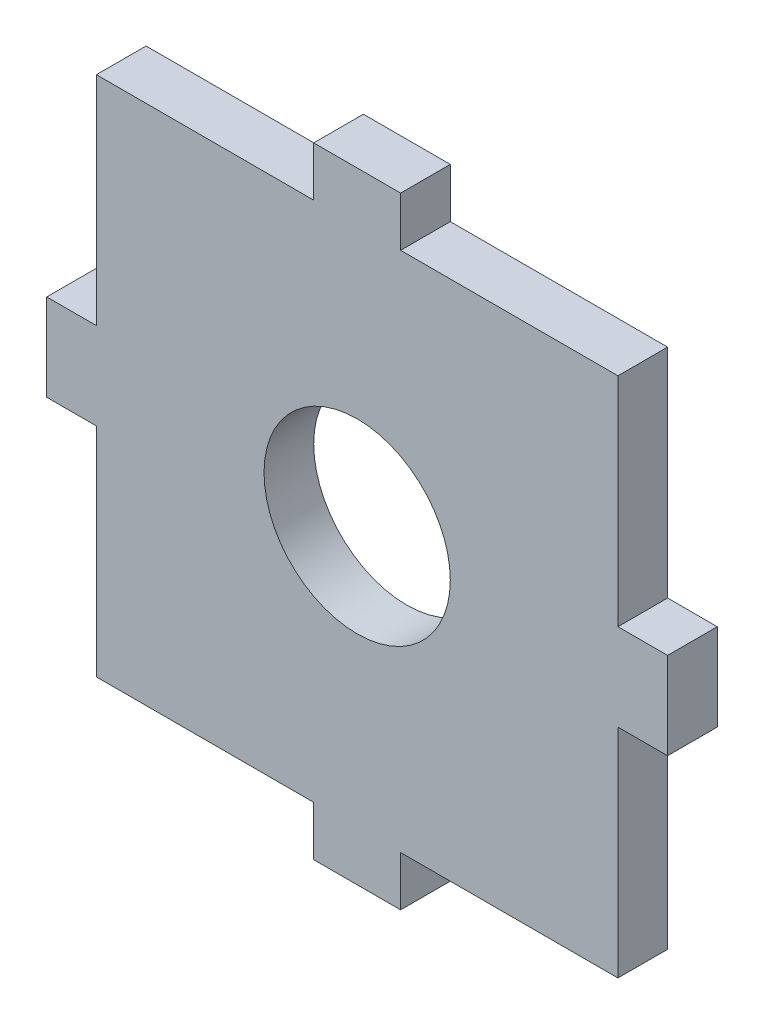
ISO-10303-21;
HEADER;
FILE_DESCRIPTION(('STEP AP214'),'2;1');
FILE_NAME('part.step','',(''),(''),'','','');
FILE_SCHEMA(('AUTOMOTIVE_DESIGN { 1 0 10303 214 1 1 1 1 }'));
ENDSEC;
DATA;
#1=APPLICATION_CONTEXT('core data for automotive mechanical design processes');
#2=APPLICATION_PROTOCOL_DEFINITION('international standard','automotive_design',2000,#1);
#3=PRODUCT_CONTEXT('',#1,'mechanical');
#4=PRODUCT('Part','Part','',(#3));
#5=PRODUCT_RELATED_PRODUCT_CATEGORY('part','',(#4));
#6=PRODUCT_DEFINITION_FORMATION('','',#4);
#7=PRODUCT_DEFINITION_CONTEXT('part definition',#1,'design');
#8=PRODUCT_DEFINITION('design','',#6,#7);
#9=PRODUCT_DEFINITION_SHAPE('','',#8);
#10=(LENGTH_UNIT() NAMED_UNIT(*) SI_UNIT(.MILLI.,.METRE.));
#11=(NAMED_UNIT(*) PLANE_ANGLE_UNIT() SI_UNIT($,.RADIAN.));
#12=(NAMED_UNIT(*) SI_UNIT($,.STERADIAN.) SOLID_ANGLE_UNIT());
#13=UNCERTAINTY_MEASURE_WITH_UNIT(LENGTH_MEASURE(1.E-05),#10,'distance_accuracy_value','');
#14=(GEOMETRIC_REPRESENTATION_CONTEXT(3) GLOBAL_UNCERTAINTY_ASSIGNED_CONTEXT((#13)) GLOBAL_UNIT_ASSIGNED_CONTEXT((#10,
#11,#12)) REPRESENTATION_CONTEXT('',''));
#15=CARTESIAN_POINT('',(0.,0.,0.));
#16=DIRECTION('',(0.,0.,1.));
#17=DIRECTION('',(1.,0.,0.));
#18=AXIS2_PLACEMENT_3D('',#15,#16,#17);
#19=CARTESIAN_POINT('',(0.,6.63529391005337,4.));
#20=DIRECTION('',(0.,1.,0.));
#21=DIRECTION('',(-1.,0.,0.));
#22=AXIS2_PLACEMENT_3D('',#19,#20,#21);
#23=PLANE('',#22);
#24=DIRECTION('',(1.,0.,0.));
#25=VECTOR('',#24,1.);
#26=CARTESIAN_POINT('',(0.,6.63529391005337,0.));
#27=LINE('',#26,#25);
#28=CARTESIAN_POINT('',(-0.138998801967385,6.63529391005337,0.));
#29=VERTEX_POINT('',#28);
#30=CARTESIAN_POINT('',(17.3610011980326,6.63529391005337,0.));
#31=VERTEX_POINT('',#30);
#32=EDGE_CURVE('E205',#29,#31,#27,.T.);
#33=ORIENTED_EDGE('',*,*,#32,.F.);
#34=DIRECTION('',(0.,0.,-1.));
#35=VECTOR('',#34,1.);
#36=CARTESIAN_POINT('',(-0.138998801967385,6.63529391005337,4.));
#37=LINE('',#36,#35);
#38=CARTESIAN_POINT('',(-0.138998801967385,6.63529391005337,4.));
#39=VERTEX_POINT('',#38);
#40=EDGE_CURVE('E11',#39,#29,#37,.T.);
#41=ORIENTED_EDGE('',*,*,#40,.F.);
#42=DIRECTION('',(1.,0.,0.));
#43=VECTOR('',#42,1.);
#44=CARTESIAN_POINT('',(0.,6.63529391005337,4.));
#45=LINE('',#44,#43);
#46=CARTESIAN_POINT('',(17.3610011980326,6.63529391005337,4.));
#47=VERTEX_POINT('',#46);
#48=EDGE_CURVE('E259',#39,#47,#45,.T.);
#49=ORIENTED_EDGE('',*,*,#48,.T.);
#50=DIRECTION('',(0.,0.,-1.));
#51=VECTOR('',#50,1.);
#52=CARTESIAN_POINT('',(17.3610011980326,6.63529391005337,4.));
#53=LINE('',#52,#51);
#54=EDGE_CURVE('E51',#47,#31,#53,.T.);
#55=ORIENTED_EDGE('',*,*,#54,.T.);
#56=EDGE_LOOP('',(#33,#41,#49,#55));
#57=FACE_BOUND('',#56,.T.);
#58=ADVANCED_FACE('F35',(#57),#23,.T.);
#59=CARTESIAN_POINT('',(-0.141758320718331,5.89556732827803E-05,4.));
#60=DIRECTION('',(-0.999999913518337,0.000415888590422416,0.));
#61=DIRECTION('',(-0.000415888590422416,-0.999999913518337,0.));
#62=AXIS2_PLACEMENT_3D('',#59,#60,#61);
#63=PLANE('',#62);
#64=DIRECTION('',(0.000415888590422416,0.999999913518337,0.));
#65=VECTOR('',#64,1.);
#66=CARTESIAN_POINT('',(-0.141758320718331,5.89556732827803E-05,0.));
#67=LINE('',#66,#65);
#68=CARTESIAN_POINT('',(-0.137337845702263,10.6290464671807,0.));
#69=VERTEX_POINT('',#68);
#70=EDGE_CURVE('E207',#29,#69,#67,.T.);
#71=ORIENTED_EDGE('',*,*,#70,.T.);
#72=DIRECTION('',(0.,0.,-1.));
#73=VECTOR('',#72,1.);
#74=CARTESIAN_POINT('',(-0.137337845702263,10.6290464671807,4.));
#75=LINE('',#74,#73);
#76=CARTESIAN_POINT('',(-0.137337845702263,10.6290464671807,4.));
#77=VERTEX_POINT('',#76);
#78=EDGE_CURVE('E43',#77,#69,#75,.T.);
#79=ORIENTED_EDGE('',*,*,#78,.F.);
#80=DIRECTION('',(0.000415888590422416,0.999999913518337,0.));
#81=VECTOR('',#80,1.);
#82=CARTESIAN_POINT('',(-0.141758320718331,5.89556732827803E-05,4.));
#83=LINE('',#82,#81);
#84=EDGE_CURVE('E318',#39,#77,#83,.T.);
#85=ORIENTED_EDGE('',*,*,#84,.F.);
#86=ORIENTED_EDGE('',*,*,#40,.T.);
#87=EDGE_LOOP('',(#71,#79,#85,#86));
#88=FACE_BOUND('',#87,.T.);
#89=ADVANCED_FACE('F304',(#88),#63,.F.);
#90=CARTESIAN_POINT('',(0.,10.6290464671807,4.));
#91=DIRECTION('',(0.,1.,0.));
#92=DIRECTION('',(0.,0.,1.));
#93=AXIS2_PLACEMENT_3D('',#90,#91,#92);
#94=PLANE('',#93);
#95=DIRECTION('',(1.,0.,0.));
#96=VECTOR('',#95,1.);
#97=CARTESIAN_POINT('',(0.,10.6290464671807,0.));
#98=LINE('',#97,#96);
#99=CARTESIAN_POINT('',(-7.13733784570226,10.6290464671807,0.));
#100=VERTEX_POINT('',#99);
#101=EDGE_CURVE('E210',#100,#69,#98,.T.);
#102=ORIENTED_EDGE('',*,*,#101,.F.);
#103=DIRECTION('',(0.,0.,-1.));
#104=VECTOR('',#103,1.);
#105=CARTESIAN_POINT('',(-7.13733784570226,10.6290464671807,4.));
#106=LINE('',#105,#104);
#107=CARTESIAN_POINT('',(-7.13733784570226,10.6290464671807,4.));
#108=VERTEX_POINT('',#107);
#109=EDGE_CURVE('E294',#108,#100,#106,.T.);
#110=ORIENTED_EDGE('',*,*,#109,.F.);
#111=DIRECTION('',(1.,0.,0.));
#112=VECTOR('',#111,1.);
#113=CARTESIAN_POINT('',(0.,10.6290464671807,4.));
#114=LINE('',#113,#112);
#115=EDGE_CURVE('E301',#108,#77,#114,.T.);
#116=ORIENTED_EDGE('',*,*,#115,.T.);
#117=ORIENTED_EDGE('',*,*,#78,.T.);
#118=EDGE_LOOP('',(#102,#110,#116,#117));
#119=FACE_BOUND('',#118,.T.);
#120=ADVANCED_FACE('F299',(#119),#94,.T.);
#121=CARTESIAN_POINT('',(-7.13733784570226,0.,4.));
#122=DIRECTION('',(-1.,0.,0.));
#123=DIRECTION('',(0.,0.,1.));
#124=AXIS2_PLACEMENT_3D('',#121,#122,#123);
#125=PLANE('',#124);
#126=DIRECTION('',(0.,1.,0.));
#127=VECTOR('',#126,1.);
#128=CARTESIAN_POINT('',(-7.13733784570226,0.,0.));
#129=LINE('',#128,#127);
#130=CARTESIAN_POINT('',(-7.13733784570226,6.63529391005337,0.));
#131=VERTEX_POINT('',#130);
#132=EDGE_CURVE('E213',#131,#100,#129,.T.);
#133=ORIENTED_EDGE('',*,*,#132,.F.);
#134=DIRECTION('',(0.,0.,-1.));
#135=VECTOR('',#134,1.);
#136=CARTESIAN_POINT('',(-7.13733784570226,6.63529391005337,4.));
#137=LINE('',#136,#135);
#138=CARTESIAN_POINT('',(-7.13733784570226,6.63529391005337,4.));
#139=VERTEX_POINT('',#138);
#140=EDGE_CURVE('E292',#139,#131,#137,.T.);
#141=ORIENTED_EDGE('',*,*,#140,.F.);
#142=DIRECTION('',(0.,1.,0.));
#143=VECTOR('',#142,1.);
#144=CARTESIAN_POINT('',(-7.13733784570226,0.,4.));
#145=LINE('',#144,#143);
#146=EDGE_CURVE('E315',#139,#108,#145,.T.);
#147=ORIENTED_EDGE('',*,*,#146,.T.);
#148=ORIENTED_EDGE('',*,*,#109,.T.);
#149=EDGE_LOOP('',(#133,#141,#147,#148));
#150=FACE_BOUND('',#149,.T.);
#151=ADVANCED_FACE('F312',(#150),#125,.T.);
#152=CARTESIAN_POINT('',(0.,6.63529391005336,4.));
#153=DIRECTION('',(0.,1.,0.));
#154=DIRECTION('',(-1.,0.,0.));
#155=AXIS2_PLACEMENT_3D('',#152,#153,#154);
#156=PLANE('',#155);
#157=DIRECTION('',(1.,0.,0.));
#158=VECTOR('',#157,1.);
#159=CARTESIAN_POINT('',(0.,6.63529391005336,0.));
#160=LINE('',#159,#158);
#161=CARTESIAN_POINT('',(-24.6373378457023,6.63529391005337,0.));
#162=VERTEX_POINT('',#161);
#163=EDGE_CURVE('E216',#162,#131,#160,.T.);
#164=ORIENTED_EDGE('',*,*,#163,.F.);
#165=DIRECTION('',(0.,0.,-1.));
#166=VECTOR('',#165,1.);
#167=CARTESIAN_POINT('',(-24.6373378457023,6.63529391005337,4.));
#168=LINE('',#167,#166);
#169=CARTESIAN_POINT('',(-24.6373378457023,6.63529391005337,4.));
#170=VERTEX_POINT('',#169);
#171=EDGE_CURVE('E290',#170,#162,#168,.T.);
#172=ORIENTED_EDGE('',*,*,#171,.F.);
#173=DIRECTION('',(1.,0.,0.));
#174=VECTOR('',#173,1.);
#175=CARTESIAN_POINT('',(0.,6.63529391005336,4.));
#176=LINE('',#175,#174);
#177=EDGE_CURVE('E320',#170,#139,#176,.T.);
#178=ORIENTED_EDGE('',*,*,#177,.T.);
#179=ORIENTED_EDGE('',*,*,#140,.T.);
#180=EDGE_LOOP('',(#164,#172,#178,#179));
#181=FACE_BOUND('',#180,.T.);
#182=ADVANCED_FACE('F517',(#181),#156,.T.);
#183=CARTESIAN_POINT('',(-24.6373378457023,0.,4.));
#184=DIRECTION('',(1.,0.,0.));
#185=DIRECTION('',(0.,0.,-1.));
#186=AXIS2_PLACEMENT_3D('',#183,#184,#185);
#187=PLANE('',#186);
#188=DIRECTION('',(0.,-1.,0.));
#189=VECTOR('',#188,1.);
#190=CARTESIAN_POINT('',(-24.6373378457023,0.,0.));
#191=LINE('',#190,#189);
#192=CARTESIAN_POINT('',(-24.6373378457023,-10.8647060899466,0.));
#193=VERTEX_POINT('',#192);
#194=EDGE_CURVE('E219',#162,#193,#191,.T.);
#195=ORIENTED_EDGE('',*,*,#194,.T.);
#196=DIRECTION('',(0.,0.,-1.));
#197=VECTOR('',#196,1.);
#198=CARTESIAN_POINT('',(-24.6373378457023,-10.8647060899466,4.));
#199=LINE('',#198,#197);
#200=CARTESIAN_POINT('',(-24.6373378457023,-10.8647060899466,4.));
#201=VERTEX_POINT('',#200);
#202=EDGE_CURVE('E288',#201,#193,#199,.T.);
#203=ORIENTED_EDGE('',*,*,#202,.F.);
#204=DIRECTION('',(0.,-1.,0.));
#205=VECTOR('',#204,1.);
#206=CARTESIAN_POINT('',(-24.6373378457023,0.,4.));
#207=LINE('',#206,#205);
#208=EDGE_CURVE('E326',#170,#201,#207,.T.);
#209=ORIENTED_EDGE('',*,*,#208,.F.);
#210=ORIENTED_EDGE('',*,*,#171,.T.);
#211=EDGE_LOOP('',(#195,#203,#209,#210));
#212=FACE_BOUND('',#211,.T.);
#213=ADVANCED_FACE('F508',(#212),#187,.F.);
#214=CARTESIAN_POINT('',(0.,-10.8647060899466,4.));
#215=DIRECTION('',(0.,1.,0.));
#216=DIRECTION('',(0.,0.,1.));
#217=AXIS2_PLACEMENT_3D('',#214,#215,#216);
#218=PLANE('',#217);
#219=DIRECTION('',(1.,0.,0.));
#220=VECTOR('',#219,1.);
#221=CARTESIAN_POINT('',(0.,-10.8647060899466,0.));
#222=LINE('',#221,#220);
#223=CARTESIAN_POINT('',(-28.6373378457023,-10.8647060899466,0.));
#224=VERTEX_POINT('',#223);
#225=EDGE_CURVE('E222',#224,#193,#222,.T.);
#226=ORIENTED_EDGE('',*,*,#225,.F.);
#227=DIRECTION('',(0.,0.,-1.));
#228=VECTOR('',#227,1.);
#229=CARTESIAN_POINT('',(-28.6373378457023,-10.8647060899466,4.));
#230=LINE('',#229,#228);
#231=CARTESIAN_POINT('',(-28.6373378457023,-10.8647060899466,4.));
#232=VERTEX_POINT('',#231);
#233=EDGE_CURVE('E286',#232,#224,#230,.T.);
#234=ORIENTED_EDGE('',*,*,#233,.F.);
#235=DIRECTION('',(1.,0.,0.));
#236=VECTOR('',#235,1.);
#237=CARTESIAN_POINT('',(0.,-10.8647060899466,4.));
#238=LINE('',#237,#236);
#239=EDGE_CURVE('E328',#232,#201,#238,.T.);
#240=ORIENTED_EDGE('',*,*,#239,.T.);
#241=ORIENTED_EDGE('',*,*,#202,.T.);
#242=EDGE_LOOP('',(#226,#234,#240,#241));
#243=FACE_BOUND('',#242,.T.);
#244=ADVANCED_FACE('F499',(#243),#218,.T.);
#245=CARTESIAN_POINT('',(-28.6373378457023,0.,4.));
#246=DIRECTION('',(1.,0.,0.));
#247=DIRECTION('',(0.,0.,-1.));
#248=AXIS2_PLACEMENT_3D('',#245,#246,#247);
#249=PLANE('',#248);
#250=DIRECTION('',(0.,-1.,0.));
#251=VECTOR('',#250,1.);
#252=CARTESIAN_POINT('',(-28.6373378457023,0.,0.));
#253=LINE('',#252,#251);
#254=CARTESIAN_POINT('',(-28.6373378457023,-17.8647060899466,0.));
#255=VERTEX_POINT('',#254);
#256=EDGE_CURVE('E225',#224,#255,#253,.T.);
#257=ORIENTED_EDGE('',*,*,#256,.T.);
#258=DIRECTION('',(0.,0.,-1.));
#259=VECTOR('',#258,1.);
#260=CARTESIAN_POINT('',(-28.6373378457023,-17.8647060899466,4.));
#261=LINE('',#260,#259);
#262=CARTESIAN_POINT('',(-28.6373378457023,-17.8647060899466,4.));
#263=VERTEX_POINT('',#262);
#264=EDGE_CURVE('E283',#263,#255,#261,.T.);
#265=ORIENTED_EDGE('',*,*,#264,.F.);
#266=DIRECTION('',(0.,-1.,0.));
#267=VECTOR('',#266,1.);
#268=CARTESIAN_POINT('',(-28.6373378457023,0.,4.));
#269=LINE('',#268,#267);
#270=EDGE_CURVE('E331',#232,#263,#269,.T.);
#271=ORIENTED_EDGE('',*,*,#270,.F.);
#272=ORIENTED_EDGE('',*,*,#233,.T.);
#273=EDGE_LOOP('',(#257,#265,#271,#272));
#274=FACE_BOUND('',#273,.T.);
#275=ADVANCED_FACE('F490',(#274),#249,.F.);
#276=CARTESIAN_POINT('',(0.,-17.8647060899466,4.));
#277=DIRECTION('',(0.,1.,0.));
#278=DIRECTION('',(0.,0.,1.));
#279=AXIS2_PLACEMENT_3D('',#276,#277,#278);
#280=PLANE('',#279);
#281=DIRECTION('',(1.,0.,0.));
#282=VECTOR('',#281,1.);
#283=CARTESIAN_POINT('',(0.,-17.8647060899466,0.));
#284=LINE('',#283,#282);
#285=CARTESIAN_POINT('',(-24.6373378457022,-17.8647060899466,0.));
#286=VERTEX_POINT('',#285);
#287=EDGE_CURVE('E227',#255,#286,#284,.T.);
#288=ORIENTED_EDGE('',*,*,#287,.T.);
#289=DIRECTION('',(0.,0.,-1.));
#290=VECTOR('',#289,1.);
#291=CARTESIAN_POINT('',(-24.6373378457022,-17.8647060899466,4.));
#292=LINE('',#291,#290);
#293=CARTESIAN_POINT('',(-24.6373378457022,-17.8647060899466,4.));
#294=VERTEX_POINT('',#293);
#295=EDGE_CURVE('E280',#294,#286,#292,.T.);
#296=ORIENTED_EDGE('',*,*,#295,.F.);
#297=DIRECTION('',(1.,0.,0.));
#298=VECTOR('',#297,1.);
#299=CARTESIAN_POINT('',(0.,-17.8647060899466,4.));
#300=LINE('',#299,#298);
#301=EDGE_CURVE('E333',#263,#294,#300,.T.);
#302=ORIENTED_EDGE('',*,*,#301,.F.);
#303=ORIENTED_EDGE('',*,*,#264,.T.);
#304=EDGE_LOOP('',(#288,#296,#302,#303));
#305=FACE_BOUND('',#304,.T.);
#306=ADVANCED_FACE('F481',(#305),#280,.F.);
#307=CARTESIAN_POINT('',(-24.6373378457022,0.,4.));
#308=DIRECTION('',(1.,0.,0.));
#309=DIRECTION('',(0.,1.,0.));
#310=AXIS2_PLACEMENT_3D('',#307,#308,#309);
#311=PLANE('',#310);
#312=DIRECTION('',(0.,-1.,0.));
#313=VECTOR('',#312,1.);
#314=CARTESIAN_POINT('',(-24.6373378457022,0.,0.));
#315=LINE('',#314,#313);
#316=CARTESIAN_POINT('',(-24.6373378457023,-35.3647060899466,0.));
#317=VERTEX_POINT('',#316);
#318=EDGE_CURVE('E229',#286,#317,#315,.T.);
#319=ORIENTED_EDGE('',*,*,#318,.T.);
#320=DIRECTION('',(0.,0.,-1.));
#321=VECTOR('',#320,1.);
#322=CARTESIAN_POINT('',(-24.6373378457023,-35.3647060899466,4.));
#323=LINE('',#322,#321);
#324=CARTESIAN_POINT('',(-24.6373378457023,-35.3647060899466,4.));
#325=VERTEX_POINT('',#324);
#326=EDGE_CURVE('E277',#325,#317,#323,.T.);
#327=ORIENTED_EDGE('',*,*,#326,.F.);
#328=DIRECTION('',(0.,-1.,0.));
#329=VECTOR('',#328,1.);
#330=CARTESIAN_POINT('',(-24.6373378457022,0.,4.));
#331=LINE('',#330,#329);
#332=EDGE_CURVE('E335',#294,#325,#331,.T.);
#333=ORIENTED_EDGE('',*,*,#332,.F.);
#334=ORIENTED_EDGE('',*,*,#295,.T.);
#335=EDGE_LOOP('',(#319,#327,#333,#334));
#336=FACE_BOUND('',#335,.T.);
#337=ADVANCED_FACE('F472',(#336),#311,.F.);
#338=CARTESIAN_POINT('',(0.,-35.3647060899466,4.));
#339=DIRECTION('',(0.,1.,0.));
#340=DIRECTION('',(0.,0.,1.));
#341=AXIS2_PLACEMENT_3D('',#338,#339,#340);
#342=PLANE('',#341);
#343=DIRECTION('',(1.,0.,0.));
#344=VECTOR('',#343,1.);
#345=CARTESIAN_POINT('',(0.,-35.3647060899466,0.));
#346=LINE('',#345,#344);
#347=CARTESIAN_POINT('',(-7.13733784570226,-35.3647060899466,0.));
#348=VERTEX_POINT('',#347);
#349=EDGE_CURVE('E231',#317,#348,#346,.T.);
#350=ORIENTED_EDGE('',*,*,#349,.T.);
#351=DIRECTION('',(0.,0.,-1.));
#352=VECTOR('',#351,1.);
#353=CARTESIAN_POINT('',(-7.13733784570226,-35.3647060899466,4.));
#354=LINE('',#353,#352);
#355=CARTESIAN_POINT('',(-7.13733784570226,-35.3647060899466,4.));
#356=VERTEX_POINT('',#355);
#357=EDGE_CURVE('E274',#356,#348,#354,.T.);
#358=ORIENTED_EDGE('',*,*,#357,.F.);
#359=DIRECTION('',(1.,0.,0.));
#360=VECTOR('',#359,1.);
#361=CARTESIAN_POINT('',(0.,-35.3647060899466,4.));
#362=LINE('',#361,#360);
#363=EDGE_CURVE('E337',#325,#356,#362,.T.);
#364=ORIENTED_EDGE('',*,*,#363,.F.);
#365=ORIENTED_EDGE('',*,*,#326,.T.);
#366=EDGE_LOOP('',(#350,#358,#364,#365));
#367=FACE_BOUND('',#366,.T.);
#368=ADVANCED_FACE('F463',(#367),#342,.F.);
#369=CARTESIAN_POINT('',(-7.13733784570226,0.,4.));
#370=DIRECTION('',(1.,0.,0.));
#371=DIRECTION('',(0.,0.,-1.));
#372=AXIS2_PLACEMENT_3D('',#369,#370,#371);
#373=PLANE('',#372);
#374=DIRECTION('',(0.,-1.,0.));
#375=VECTOR('',#374,1.);
#376=CARTESIAN_POINT('',(-7.13733784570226,0.,0.));
#377=LINE('',#376,#375);
#378=CARTESIAN_POINT('',(-7.13733784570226,-39.3647060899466,0.));
#379=VERTEX_POINT('',#378);
#380=EDGE_CURVE('E233',#348,#379,#377,.T.);
#381=ORIENTED_EDGE('',*,*,#380,.T.);
#382=DIRECTION('',(0.,0.,-1.));
#383=VECTOR('',#382,1.);
#384=CARTESIAN_POINT('',(-7.13733784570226,-39.3647060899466,4.));
#385=LINE('',#384,#383);
#386=CARTESIAN_POINT('',(-7.13733784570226,-39.3647060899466,4.));
#387=VERTEX_POINT('',#386);
#388=EDGE_CURVE('E271',#387,#379,#385,.T.);
#389=ORIENTED_EDGE('',*,*,#388,.F.);
#390=DIRECTION('',(0.,-1.,0.));
#391=VECTOR('',#390,1.);
#392=CARTESIAN_POINT('',(-7.13733784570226,0.,4.));
#393=LINE('',#392,#391);
#394=EDGE_CURVE('E339',#356,#387,#393,.T.);
#395=ORIENTED_EDGE('',*,*,#394,.F.);
#396=ORIENTED_EDGE('',*,*,#357,.T.);
#397=EDGE_LOOP('',(#381,#389,#395,#396));
#398=FACE_BOUND('',#397,.T.);
#399=ADVANCED_FACE('F454',(#398),#373,.F.);
#400=CARTESIAN_POINT('',(0.,-39.3647060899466,4.));
#401=DIRECTION('',(0.,1.,0.));
#402=DIRECTION('',(0.,0.,1.));
#403=AXIS2_PLACEMENT_3D('',#400,#401,#402);
#404=PLANE('',#403);
#405=DIRECTION('',(1.,0.,0.));
#406=VECTOR('',#405,1.);
#407=CARTESIAN_POINT('',(0.,-39.3647060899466,0.));
#408=LINE('',#407,#406);
#409=CARTESIAN_POINT('',(-0.138998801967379,-39.3647060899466,0.));
#410=VERTEX_POINT('',#409);
#411=EDGE_CURVE('E235',#379,#410,#408,.T.);
#412=ORIENTED_EDGE('',*,*,#411,.T.);
#413=DIRECTION('',(0.,0.,-1.));
#414=VECTOR('',#413,1.);
#415=CARTESIAN_POINT('',(-0.138998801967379,-39.3647060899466,4.));
#416=LINE('',#415,#414);
#417=CARTESIAN_POINT('',(-0.138998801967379,-39.3647060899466,4.));
#418=VERTEX_POINT('',#417);
#419=EDGE_CURVE('E269',#418,#410,#416,.T.);
#420=ORIENTED_EDGE('',*,*,#419,.F.);
#421=DIRECTION('',(1.,0.,0.));
#422=VECTOR('',#421,1.);
#423=CARTESIAN_POINT('',(0.,-39.3647060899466,4.));
#424=LINE('',#423,#422);
#425=EDGE_CURVE('E341',#387,#418,#424,.T.);
#426=ORIENTED_EDGE('',*,*,#425,.F.);
#427=ORIENTED_EDGE('',*,*,#388,.T.);
#428=EDGE_LOOP('',(#412,#420,#426,#427));
#429=FACE_BOUND('',#428,.T.);
#430=ADVANCED_FACE('F445',(#429),#404,.F.);
#431=CARTESIAN_POINT('',(-0.138998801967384,0.,4.));
#432=DIRECTION('',(1.,0.,0.));
#433=DIRECTION('',(0.,1.,0.));
#434=AXIS2_PLACEMENT_3D('',#431,#432,#433);
#435=PLANE('',#434);
#436=DIRECTION('',(0.,-1.,0.));
#437=VECTOR('',#436,1.);
#438=CARTESIAN_POINT('',(-0.138998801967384,0.,0.));
#439=LINE('',#438,#437);
#440=CARTESIAN_POINT('',(-0.138998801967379,-35.3647060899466,0.));
#441=VERTEX_POINT('',#440);
#442=EDGE_CURVE('E238',#441,#410,#439,.T.);
#443=ORIENTED_EDGE('',*,*,#442,.F.);
#444=DIRECTION('',(0.,0.,-1.));
#445=VECTOR('',#444,1.);
#446=CARTESIAN_POINT('',(-0.138998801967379,-35.3647060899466,4.));
#447=LINE('',#446,#445);
#448=CARTESIAN_POINT('',(-0.138998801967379,-35.3647060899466,4.));
#449=VERTEX_POINT('',#448);
#450=EDGE_CURVE('E267',#449,#441,#447,.T.);
#451=ORIENTED_EDGE('',*,*,#450,.F.);
#452=DIRECTION('',(0.,-1.,0.));
#453=VECTOR('',#452,1.);
#454=CARTESIAN_POINT('',(-0.138998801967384,0.,4.));
#455=LINE('',#454,#453);
#456=EDGE_CURVE('E343',#449,#418,#455,.T.);
#457=ORIENTED_EDGE('',*,*,#456,.T.);
#458=ORIENTED_EDGE('',*,*,#419,.T.);
#459=EDGE_LOOP('',(#443,#451,#457,#458));
#460=FACE_BOUND('',#459,.T.);
#461=ADVANCED_FACE('F437',(#460),#435,.T.);
#462=CARTESIAN_POINT('',(0.,-35.3647060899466,4.));
#463=DIRECTION('',(0.,1.,0.));
#464=DIRECTION('',(0.,0.,1.));
#465=AXIS2_PLACEMENT_3D('',#462,#463,#464);
#466=PLANE('',#465);
#467=DIRECTION('',(1.,0.,0.));
#468=VECTOR('',#467,1.);
#469=CARTESIAN_POINT('',(0.,-35.3647060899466,0.));
#470=LINE('',#469,#468);
#471=CARTESIAN_POINT('',(17.3610011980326,-35.3647060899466,0.));
#472=VERTEX_POINT('',#471);
#473=EDGE_CURVE('E241',#441,#472,#470,.T.);
#474=ORIENTED_EDGE('',*,*,#473,.T.);
#475=DIRECTION('',(0.,0.,-1.));
#476=VECTOR('',#475,1.);
#477=CARTESIAN_POINT('',(17.3610011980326,-35.3647060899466,4.));
#478=LINE('',#477,#476);
#479=CARTESIAN_POINT('',(17.3610011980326,-35.3647060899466,4.));
#480=VERTEX_POINT('',#479);
#481=EDGE_CURVE('E265',#480,#472,#478,.T.);
#482=ORIENTED_EDGE('',*,*,#481,.F.);
#483=DIRECTION('',(1.,0.,0.));
#484=VECTOR('',#483,1.);
#485=CARTESIAN_POINT('',(0.,-35.3647060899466,4.));
#486=LINE('',#485,#484);
#487=EDGE_CURVE('E346',#449,#480,#486,.T.);
#488=ORIENTED_EDGE('',*,*,#487,.F.);
#489=ORIENTED_EDGE('',*,*,#450,.T.);
#490=EDGE_LOOP('',(#474,#482,#488,#489));
#491=FACE_BOUND('',#490,.T.);
#492=ADVANCED_FACE('F357',(#491),#466,.F.);
#493=CARTESIAN_POINT('',(17.3610011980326,0.,4.));
#494=DIRECTION('',(1.,0.,0.));
#495=DIRECTION('',(0.,1.,0.));
#496=AXIS2_PLACEMENT_3D('',#493,#494,#495);
#497=PLANE('',#496);
#498=DIRECTION('',(0.,-1.,0.));
#499=VECTOR('',#498,1.);
#500=CARTESIAN_POINT('',(17.3610011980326,0.,0.));
#501=LINE('',#500,#499);
#502=CARTESIAN_POINT('',(17.3610011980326,-17.8647060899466,0.));
#503=VERTEX_POINT('',#502);
#504=EDGE_CURVE('E244',#503,#472,#501,.T.);
#505=ORIENTED_EDGE('',*,*,#504,.F.);
#506=DIRECTION('',(0.,0.,-1.));
#507=VECTOR('',#506,1.);
#508=CARTESIAN_POINT('',(17.3610011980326,-17.8647060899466,4.));
#509=LINE('',#508,#507);
#510=CARTESIAN_POINT('',(17.3610011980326,-17.8647060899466,4.));
#511=VERTEX_POINT('',#510);
#512=EDGE_CURVE('E263',#511,#503,#509,.T.);
#513=ORIENTED_EDGE('',*,*,#512,.F.);
#514=DIRECTION('',(0.,-1.,0.));
#515=VECTOR('',#514,1.);
#516=CARTESIAN_POINT('',(17.3610011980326,0.,4.));
#517=LINE('',#516,#515);
#518=EDGE_CURVE('E348',#511,#480,#517,.T.);
#519=ORIENTED_EDGE('',*,*,#518,.T.);
#520=ORIENTED_EDGE('',*,*,#481,.T.);
#521=EDGE_LOOP('',(#505,#513,#519,#520));
#522=FACE_BOUND('',#521,.T.);
#523=ADVANCED_FACE('F352',(#522),#497,.T.);
#524=CARTESIAN_POINT('',(0.,-17.8647060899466,4.));
#525=DIRECTION('',(0.,1.,0.));
#526=DIRECTION('',(0.,0.,1.));
#527=AXIS2_PLACEMENT_3D('',#524,#525,#526);
#528=PLANE('',#527);
#529=DIRECTION('',(1.,0.,0.));
#530=VECTOR('',#529,1.);
#531=CARTESIAN_POINT('',(0.,-17.8647060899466,0.));
#532=LINE('',#531,#530);
#533=CARTESIAN_POINT('',(21.3610011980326,-17.8647060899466,0.));
#534=VERTEX_POINT('',#533);
#535=EDGE_CURVE('E247',#503,#534,#532,.T.);
#536=ORIENTED_EDGE('',*,*,#535,.T.);
#537=DIRECTION('',(0.,0.,-1.));
#538=VECTOR('',#537,1.);
#539=CARTESIAN_POINT('',(21.3610011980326,-17.8647060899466,4.));
#540=LINE('',#539,#538);
#541=CARTESIAN_POINT('',(21.3610011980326,-17.8647060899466,4.));
#542=VERTEX_POINT('',#541);
#543=EDGE_CURVE('E182',#542,#534,#540,.T.);
#544=ORIENTED_EDGE('',*,*,#543,.F.);
#545=DIRECTION('',(1.,0.,0.));
#546=VECTOR('',#545,1.);
#547=CARTESIAN_POINT('',(0.,-17.8647060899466,4.));
#548=LINE('',#547,#546);
#549=EDGE_CURVE('E193',#511,#542,#548,.T.);
#550=ORIENTED_EDGE('',*,*,#549,.F.);
#551=ORIENTED_EDGE('',*,*,#512,.T.);
#552=EDGE_LOOP('',(#536,#544,#550,#551));
#553=FACE_BOUND('',#552,.T.);
#554=ADVANCED_FACE('F362',(#553),#528,.F.);
#555=CARTESIAN_POINT('',(21.3610011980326,0.,4.));
#556=DIRECTION('',(1.,0.,0.));
#557=DIRECTION('',(0.,0.,-1.));
#558=AXIS2_PLACEMENT_3D('',#555,#556,#557);
#559=PLANE('',#558);
#560=DIRECTION('',(0.,-1.,0.));
#561=VECTOR('',#560,1.);
#562=CARTESIAN_POINT('',(21.3610011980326,0.,0.));
#563=LINE('',#562,#561);
#564=CARTESIAN_POINT('',(21.3610011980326,-10.8647060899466,0.));
#565=VERTEX_POINT('',#564);
#566=EDGE_CURVE('E178',#565,#534,#563,.T.);
#567=ORIENTED_EDGE('',*,*,#566,.F.);
#568=DIRECTION('',(0.,0.,-1.));
#569=VECTOR('',#568,1.);
#570=CARTESIAN_POINT('',(21.3610011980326,-10.8647060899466,4.));
#571=LINE('',#570,#569);
#572=CARTESIAN_POINT('',(21.3610011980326,-10.8647060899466,4.));
#573=VERTEX_POINT('',#572);
#574=EDGE_CURVE('E173',#573,#565,#571,.T.);
#575=ORIENTED_EDGE('',*,*,#574,.F.);
#576=DIRECTION('',(0.,-1.,0.));
#577=VECTOR('',#576,1.);
#578=CARTESIAN_POINT('',(21.3610011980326,0.,4.));
#579=LINE('',#578,#577);
#580=EDGE_CURVE('E176',#573,#542,#579,.T.);
#581=ORIENTED_EDGE('',*,*,#580,.T.);
#582=ORIENTED_EDGE('',*,*,#543,.T.);
#583=EDGE_LOOP('',(#567,#575,#581,#582));
#584=FACE_BOUND('',#583,.T.);
#585=ADVANCED_FACE('F175',(#584),#559,.T.);
#586=CARTESIAN_POINT('',(0.,-10.8647060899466,4.));
#587=DIRECTION('',(0.,1.,0.));
#588=DIRECTION('',(0.,0.,1.));
#589=AXIS2_PLACEMENT_3D('',#586,#587,#588);
#590=PLANE('',#589);
#591=DIRECTION('',(1.,0.,0.));
#592=VECTOR('',#591,1.);
#593=CARTESIAN_POINT('',(0.,-10.8647060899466,0.));
#594=LINE('',#593,#592);
#595=CARTESIAN_POINT('',(17.3610011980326,-10.8647060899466,0.));
#596=VERTEX_POINT('',#595);
#597=EDGE_CURVE('E251',#596,#565,#594,.T.);
#598=ORIENTED_EDGE('',*,*,#597,.F.);
#599=DIRECTION('',(0.,0.,-1.));
#600=VECTOR('',#599,1.);
#601=CARTESIAN_POINT('',(17.3610011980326,-10.8647060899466,4.));
#602=LINE('',#601,#600);
#603=CARTESIAN_POINT('',(17.3610011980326,-10.8647060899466,4.));
#604=VERTEX_POINT('',#603);
#605=EDGE_CURVE('E112',#604,#596,#602,.T.);
#606=ORIENTED_EDGE('',*,*,#605,.F.);
#607=DIRECTION('',(1.,0.,0.));
#608=VECTOR('',#607,1.);
#609=CARTESIAN_POINT('',(0.,-10.8647060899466,4.));
#610=LINE('',#609,#608);
#611=EDGE_CURVE('E190',#604,#573,#610,.T.);
#612=ORIENTED_EDGE('',*,*,#611,.T.);
#613=ORIENTED_EDGE('',*,*,#574,.T.);
#614=EDGE_LOOP('',(#598,#606,#612,#613));
#615=FACE_BOUND('',#614,.T.);
#616=ADVANCED_FACE('F196',(#615),#590,.T.);
#617=CARTESIAN_POINT('',(17.3610011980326,0.,4.));
#618=DIRECTION('',(1.,0.,0.));
#619=DIRECTION('',(0.,1.,0.));
#620=AXIS2_PLACEMENT_3D('',#617,#618,#619);
#621=PLANE('',#620);
#622=DIRECTION('',(0.,-1.,0.));
#623=VECTOR('',#622,1.);
#624=CARTESIAN_POINT('',(17.3610011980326,0.,0.));
#625=LINE('',#624,#623);
#626=EDGE_CURVE('E253',#31,#596,#625,.T.);
#627=ORIENTED_EDGE('',*,*,#626,.F.);
#628=ORIENTED_EDGE('',*,*,#54,.F.);
#629=DIRECTION('',(0.,-1.,0.));
#630=VECTOR('',#629,1.);
#631=CARTESIAN_POINT('',(17.3610011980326,0.,4.));
#632=LINE('',#631,#630);
#633=EDGE_CURVE('E197',#47,#604,#632,.T.);
#634=ORIENTED_EDGE('',*,*,#633,.T.);
#635=ORIENTED_EDGE('',*,*,#605,.T.);
#636=EDGE_LOOP('',(#627,#628,#634,#635));
#637=FACE_BOUND('',#636,.T.);
#638=ADVANCED_FACE('F375',(#637),#621,.T.);
#639=CARTESIAN_POINT('',(-3.63816832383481,-14.3647060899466,4.));
#640=DIRECTION('',(0.,0.,-1.));
#641=DIRECTION('',(-1.,0.,0.));
#642=AXIS2_PLACEMENT_3D('',#639,#640,#641);
#643=CYLINDRICAL_SURFACE('',#642,7.5);
#644=CARTESIAN_POINT('',(-3.63816832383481,-14.3647060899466,4.));
#645=DIRECTION('',(0.,0.,1.));
#646=DIRECTION('',(1.,0.,0.));
#647=AXIS2_PLACEMENT_3D('',#644,#645,#646);
#648=CIRCLE('',#647,7.5);
#649=CARTESIAN_POINT('',(3.86183167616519,-14.3647060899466,4.));
#650=VERTEX_POINT('',#649);
#651=EDGE_CURVE('E199',#650,#650,#648,.T.);
#652=ORIENTED_EDGE('',*,*,#651,.T.);
#653=EDGE_LOOP('',(#652));
#654=FACE_BOUND('',#653,.T.);
#655=CARTESIAN_POINT('',(-3.63816832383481,-14.3647060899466,0.));
#656=DIRECTION('',(0.,0.,1.));
#657=DIRECTION('',(1.,0.,0.));
#658=AXIS2_PLACEMENT_3D('',#655,#656,#657);
#659=CIRCLE('',#658,7.5);
#660=CARTESIAN_POINT('',(3.86183167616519,-14.3647060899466,0.));
#661=VERTEX_POINT('',#660);
#662=EDGE_CURVE('E256',#661,#661,#659,.T.);
#663=ORIENTED_EDGE('',*,*,#662,.F.);
#664=EDGE_LOOP('',(#663));
#665=FACE_BOUND('',#664,.T.);
#666=ADVANCED_FACE('F377',(#654,#665),#643,.F.);
#667=CARTESIAN_POINT('',(0.,0.,4.));
#668=DIRECTION('',(0.,0.,1.));
#669=DIRECTION('',(1.,0.,0.));
#670=AXIS2_PLACEMENT_3D('',#667,#668,#669);
#671=PLANE('',#670);
#672=ORIENTED_EDGE('',*,*,#48,.F.);
#673=ORIENTED_EDGE('',*,*,#84,.T.);
#674=ORIENTED_EDGE('',*,*,#115,.F.);
#675=ORIENTED_EDGE('',*,*,#146,.F.);
#676=ORIENTED_EDGE('',*,*,#177,.F.);
#677=ORIENTED_EDGE('',*,*,#208,.T.);
#678=ORIENTED_EDGE('',*,*,#239,.F.);
#679=ORIENTED_EDGE('',*,*,#270,.T.);
#680=ORIENTED_EDGE('',*,*,#301,.T.);
#681=ORIENTED_EDGE('',*,*,#332,.T.);
#682=ORIENTED_EDGE('',*,*,#363,.T.);
#683=ORIENTED_EDGE('',*,*,#394,.T.);
#684=ORIENTED_EDGE('',*,*,#425,.T.);
#685=ORIENTED_EDGE('',*,*,#456,.F.);
#686=ORIENTED_EDGE('',*,*,#487,.T.);
#687=ORIENTED_EDGE('',*,*,#518,.F.);
#688=ORIENTED_EDGE('',*,*,#549,.T.);
#689=ORIENTED_EDGE('',*,*,#580,.F.);
#690=ORIENTED_EDGE('',*,*,#611,.F.);
#691=ORIENTED_EDGE('',*,*,#633,.F.);
#692=EDGE_LOOP('',(#672,#673,#674,#675,#676,#677,#678,#679,#680,#681,#682,#683,#684,#685,#686,
#687,#688,#689,#690,#691));
#693=FACE_BOUND('',#692,.T.);
#694=ORIENTED_EDGE('',*,*,#651,.F.);
#695=EDGE_LOOP('',(#694));
#696=FACE_BOUND('',#695,.T.);
#697=ADVANCED_FACE('F187',(#693,#696),#671,.T.);
#698=CARTESIAN_POINT('',(0.,0.,0.));
#699=DIRECTION('',(0.,0.,1.));
#700=DIRECTION('',(1.,0.,0.));
#701=AXIS2_PLACEMENT_3D('',#698,#699,#700);
#702=PLANE('',#701);
#703=ORIENTED_EDGE('',*,*,#32,.T.);
#704=ORIENTED_EDGE('',*,*,#626,.T.);
#705=ORIENTED_EDGE('',*,*,#597,.T.);
#706=ORIENTED_EDGE('',*,*,#566,.T.);
#707=ORIENTED_EDGE('',*,*,#535,.F.);
#708=ORIENTED_EDGE('',*,*,#504,.T.);
#709=ORIENTED_EDGE('',*,*,#473,.F.);
#710=ORIENTED_EDGE('',*,*,#442,.T.);
#711=ORIENTED_EDGE('',*,*,#411,.F.);
#712=ORIENTED_EDGE('',*,*,#380,.F.);
#713=ORIENTED_EDGE('',*,*,#349,.F.);
#714=ORIENTED_EDGE('',*,*,#318,.F.);
#715=ORIENTED_EDGE('',*,*,#287,.F.);
#716=ORIENTED_EDGE('',*,*,#256,.F.);
#717=ORIENTED_EDGE('',*,*,#225,.T.);
#718=ORIENTED_EDGE('',*,*,#194,.F.);
#719=ORIENTED_EDGE('',*,*,#163,.T.);
#720=ORIENTED_EDGE('',*,*,#132,.T.);
#721=ORIENTED_EDGE('',*,*,#101,.T.);
#722=ORIENTED_EDGE('',*,*,#70,.F.);
#723=EDGE_LOOP('',(#703,#704,#705,#706,#707,#708,#709,#710,#711,#712,#713,#714,#715,#716,#717,
#718,#719,#720,#721,#722));
#724=FACE_BOUND('',#723,.T.);
#725=ORIENTED_EDGE('',*,*,#662,.T.);
#726=EDGE_LOOP('',(#725));
#727=FACE_BOUND('',#726,.T.);
#728=ADVANCED_FACE('F306',(#724,#727),#702,.F.);
#729=CLOSED_SHELL('',(#58,#89,#120,#151,#182,#213,#244,#275,#306,#337,#368,#399,#430,#461,#492,
#523,#554,#585,#616,#638,#666,#697,#728));
#730=MANIFOLD_SOLID_BREP('B2',#729);
#731=ADVANCED_BREP_SHAPE_REPRESENTATION('',(#18,#730),#14);
#732=SHAPE_DEFINITION_REPRESENTATION(#9,#731);
ENDSEC;
END-ISO-10303-21;
